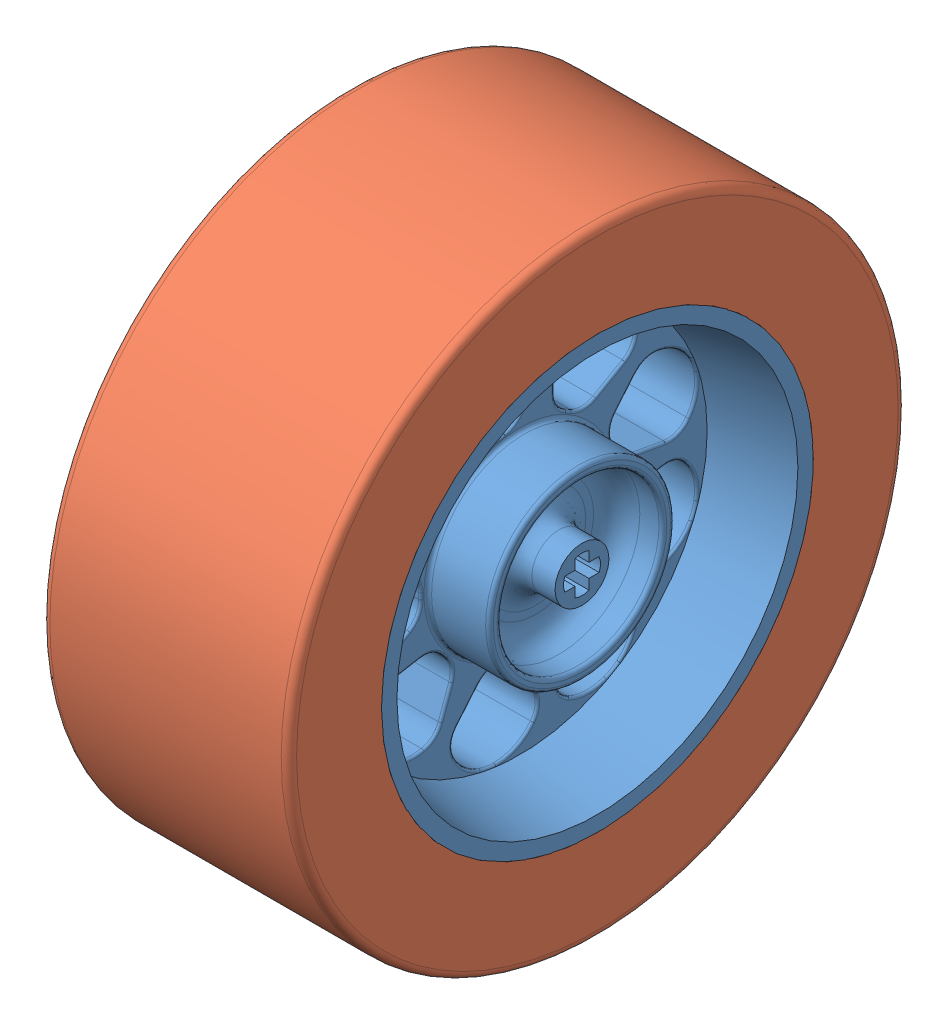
SolidWorks assembly Assem1.sldasm, configuration Default (file format 4400). Lengths in mm.
Overall size (32 80 80).
2 component instances, 2 part files, 2 mates.
Components (placement in the parent):
- Achterwiel-1: Achterwiel.SLDPRT [Default] at origin size (32 56 56)
- AchterBand-1: AchterBand.SLDPRT [Default] at origin size (32 80 80)
Mates (geometry in assembly coordinates):
- Concentric1: concentric: cylinder of Achterwiel-1 through (-109.8765 0 0) axis (-1 0 0) radius 27; cylinder of AchterBand-1 through (-79.5574 0 0) axis (-1 0 0) radius 27
- Coincident1: coincident anti-aligned: plane of Achterwiel-1 through (14 27 0) normal (-1 0 0); plane of AchterBand-1 through (14 28 0) normal (1 0 0)
